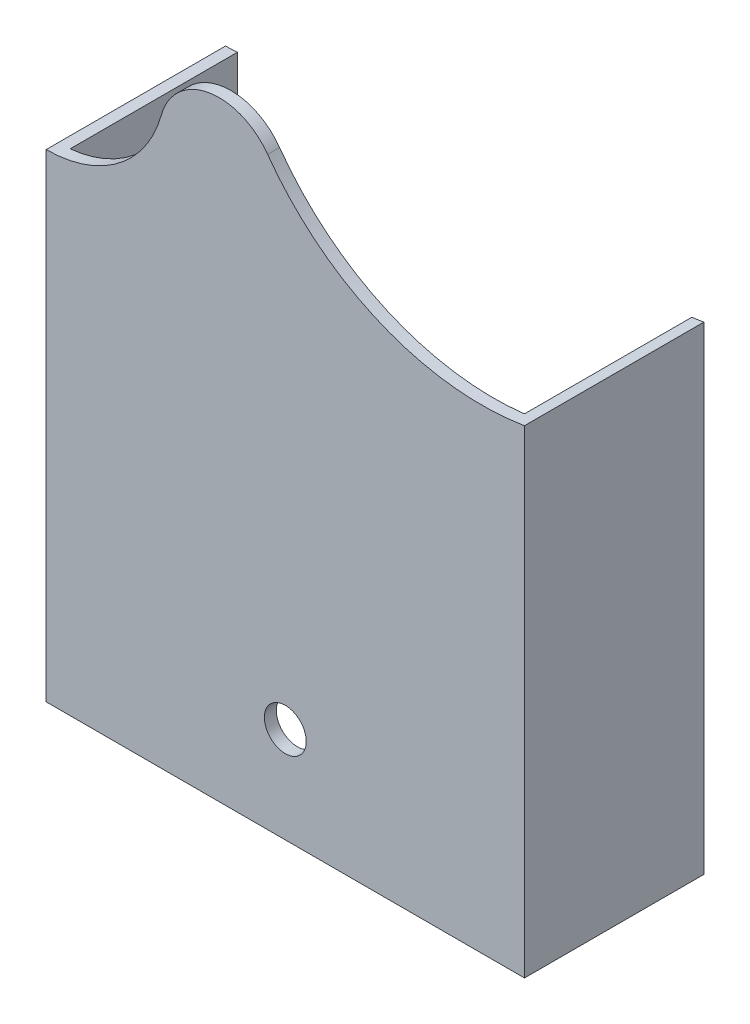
from build123d import *

# Parameters (mm, degrees)
SKETCH1_R      = 1.75
EXTRUDE1_DEPTH = 15
SKETCH2_W      = 38
SKETCH2_H      = 17.671418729
EXTRUDE2_DEPTH = 67.528189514


with BuildPart() as part:
    # Sketch1 → Extrude1 (new body)
    with BuildSketch(Plane.XY):
        with BuildLine():
            Line((0, 0), (40, 0))
            Line((40, 0), (40, 40))
            ThreePointArc((40, 40), (27.988883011, 41.385440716), (18.523771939, 48.908608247))
            ThreePointArc((18.523771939, 48.908608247), (13.584049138, 50.92323568), (9.637888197, 47.333333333))
            ThreePointArc((9.637888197, 47.333333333), (6.055300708, 42.041775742), (0, 40))
            Line((0, 40), (0, 0))
        make_face()
        with Locations((20, 8)):
            Circle(SKETCH1_R, mode=Mode.SUBTRACT)
    extrude(amount=EXTRUDE1_DEPTH)

    # Sketch2 → Extrude2 (cut, through all)
    with BuildSketch(Plane.XZ):
        with Locations((20, 5.164290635)):
            Rectangle(SKETCH2_W, SKETCH2_H)
    extrude(amount=-EXTRUDE2_DEPTH, mode=Mode.SUBTRACT)


solid = part.part
